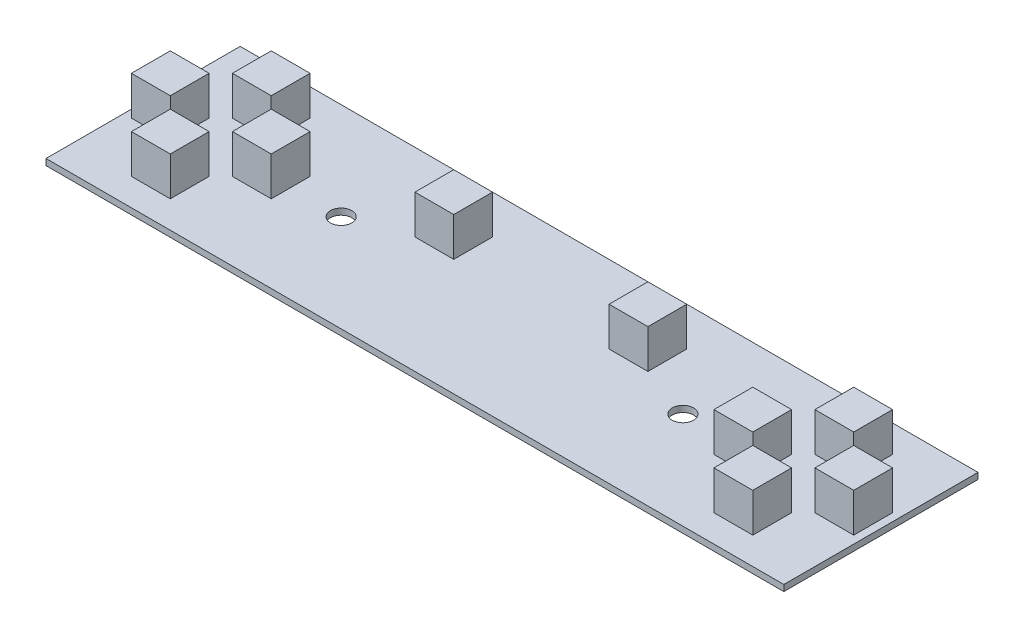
from build123d import *

# Parameters (mm, degrees)
SKETCH1_W            = 190
SKETCH1_H            = 50
BASE_DEPTH           = 0.8
SKETCH2_W            = 10
SKETCH2_H            = 10
SWITCHES_DEPTH       = 10
M5_CLEARANCE_HOLE1_D = 5.5


with BuildPart() as part:
    # Sketch1 → Base (new, symmetric)
    with BuildSketch(Plane(origin=(0, 0, 0), x_dir=(1, 0, 0), z_dir=(0, 1, 0))):
        Rectangle(SKETCH1_W, SKETCH1_H)
    extrude(amount=BASE_DEPTH, both=True)

    # Sketch2 → Switches (add)
    with BuildSketch(Plane(origin=(0, 0.8, 0), x_dir=(1, 0, 0), z_dir=(0, 1, 0))):
        with Locations((-62, 0)):
            Rectangle(SKETCH2_W, SKETCH2_H)
        with Locations((-75, 13)):
            Rectangle(SKETCH2_W, SKETCH2_H)
        with Locations((-75, -13)):
            Rectangle(SKETCH2_W, SKETCH2_H)
        with Locations((-88, 0)):
            Rectangle(SKETCH2_W, SKETCH2_H)
        with Locations((-25, 10)):
            Rectangle(SKETCH2_W, SKETCH2_H)
        with Locations((25, 10)):
            Rectangle(SKETCH2_W, SKETCH2_H)
        with Locations((88, 0)):
            Rectangle(SKETCH2_W, SKETCH2_H)
        with Locations((75, -13)):
            Rectangle(SKETCH2_W, SKETCH2_H)
        with Locations((62, 0)):
            Rectangle(SKETCH2_W, SKETCH2_H)
        with Locations((75, 13)):
            Rectangle(SKETCH2_W, SKETCH2_H)
    extrude(amount=SWITCHES_DEPTH)

    # M5 Clearance Hole1 (through all)
    with Locations(Plane(origin=(0, 0.8, 0), x_dir=(1, 0, 0), z_dir=(0, 1, 0))):
        with Locations((-44, 0), (44, 0)):
            Hole(M5_CLEARANCE_HOLE1_D / 2)


solid = part.part
